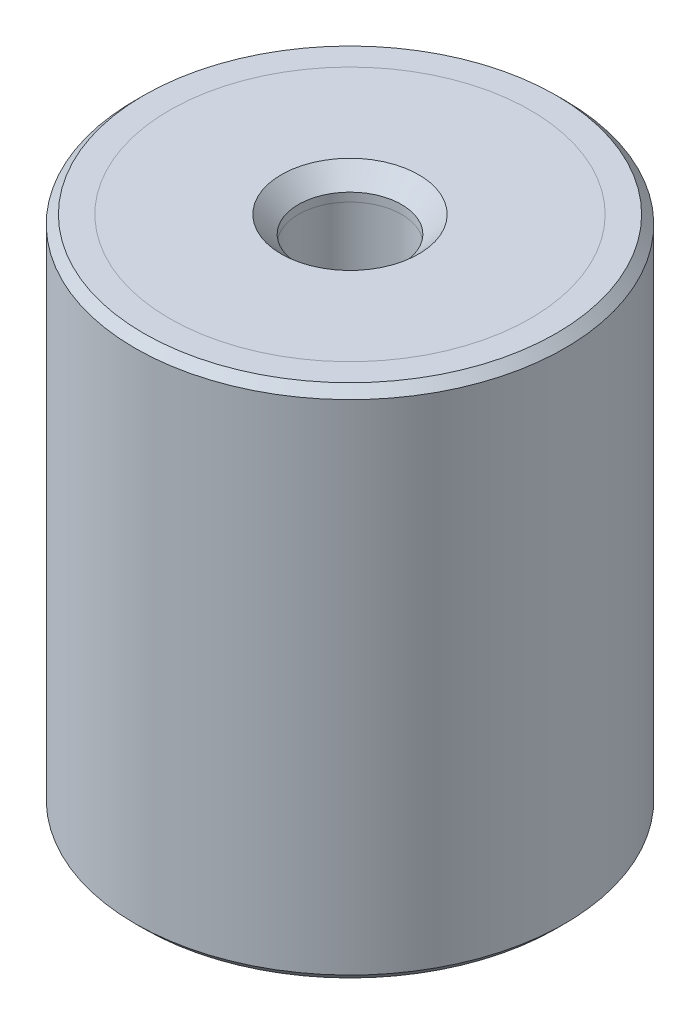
ISO-10303-21;
HEADER;
FILE_DESCRIPTION(('STEP AP214'),'2;1');
FILE_NAME('part.step','',(''),(''),'','','');
FILE_SCHEMA(('AUTOMOTIVE_DESIGN { 1 0 10303 214 1 1 1 1 }'));
ENDSEC;
DATA;
#1=APPLICATION_CONTEXT('core data for automotive mechanical design processes');
#2=APPLICATION_PROTOCOL_DEFINITION('international standard','automotive_design',2000,#1);
#3=PRODUCT_CONTEXT('',#1,'mechanical');
#4=PRODUCT('Part','Part','',(#3));
#5=PRODUCT_RELATED_PRODUCT_CATEGORY('part','',(#4));
#6=PRODUCT_DEFINITION_FORMATION('','',#4);
#7=PRODUCT_DEFINITION_CONTEXT('part definition',#1,'design');
#8=PRODUCT_DEFINITION('design','',#6,#7);
#9=PRODUCT_DEFINITION_SHAPE('','',#8);
#10=(LENGTH_UNIT() NAMED_UNIT(*) SI_UNIT(.MILLI.,.METRE.));
#11=(NAMED_UNIT(*) PLANE_ANGLE_UNIT() SI_UNIT($,.RADIAN.));
#12=(NAMED_UNIT(*) SI_UNIT($,.STERADIAN.) SOLID_ANGLE_UNIT());
#13=UNCERTAINTY_MEASURE_WITH_UNIT(LENGTH_MEASURE(1.E-05),#10,'distance_accuracy_value','');
#14=(GEOMETRIC_REPRESENTATION_CONTEXT(3) GLOBAL_UNCERTAINTY_ASSIGNED_CONTEXT((#13)) GLOBAL_UNIT_ASSIGNED_CONTEXT((#10,
#11,#12)) REPRESENTATION_CONTEXT('',''));
#15=CARTESIAN_POINT('',(0.,0.,0.));
#16=DIRECTION('',(0.,0.,1.));
#17=DIRECTION('',(1.,0.,0.));
#18=AXIS2_PLACEMENT_3D('',#15,#16,#17);
#19=CARTESIAN_POINT('',(0.,41.0340428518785,0.));
#20=DIRECTION('',(0.,1.,0.));
#21=DIRECTION('',(0.,0.,1.));
#22=AXIS2_PLACEMENT_3D('',#19,#20,#21);
#23=CYLINDRICAL_SURFACE('',#22,3.);
#24=CARTESIAN_POINT('',(0.,-27.5,0.));
#25=DIRECTION('',(0.,-1.,0.));
#26=DIRECTION('',(0.,0.,-1.));
#27=AXIS2_PLACEMENT_3D('',#24,#25,#26);
#28=CIRCLE('',#27,3.);
#29=CARTESIAN_POINT('',(0.,-27.5,-3.));
#30=VERTEX_POINT('',#29);
#31=EDGE_CURVE('P0_E10',#30,#30,#28,.T.);
#32=ORIENTED_EDGE('',*,*,#31,.T.);
#33=EDGE_LOOP('',(#32));
#34=FACE_BOUND('',#33,.T.);
#35=CARTESIAN_POINT('',(0.,-27.,0.));
#36=DIRECTION('',(0.,1.,0.));
#37=DIRECTION('',(0.,0.,1.));
#38=AXIS2_PLACEMENT_3D('',#35,#36,#37);
#39=CIRCLE('',#38,3.);
#40=CARTESIAN_POINT('',(0.,-27.,3.));
#41=VERTEX_POINT('',#40);
#42=EDGE_CURVE('P0_E25',#41,#41,#39,.T.);
#43=ORIENTED_EDGE('',*,*,#42,.T.);
#44=EDGE_LOOP('',(#43));
#45=FACE_BOUND('',#44,.T.);
#46=ADVANCED_FACE('P0_F14',(#34,#45),#23,.F.);
#47=CARTESIAN_POINT('',(0.,-27.,3.));
#48=DIRECTION('',(0.,1.,0.));
#49=DIRECTION('',(0.,0.,1.));
#50=AXIS2_PLACEMENT_3D('',#47,#48,#49);
#51=PLANE('',#50);
#52=CARTESIAN_POINT('',(0.,-27.,0.));
#53=DIRECTION('',(0.,1.,0.));
#54=DIRECTION('',(0.,0.,1.));
#55=AXIS2_PLACEMENT_3D('',#52,#53,#54);
#56=CIRCLE('',#55,10.5);
#57=CARTESIAN_POINT('',(0.,-27.,10.5));
#58=VERTEX_POINT('',#57);
#59=EDGE_CURVE('P0_E29',#58,#58,#56,.T.);
#60=ORIENTED_EDGE('',*,*,#59,.T.);
#61=EDGE_LOOP('',(#60));
#62=FACE_BOUND('',#61,.T.);
#63=ORIENTED_EDGE('',*,*,#42,.F.);
#64=EDGE_LOOP('',(#63));
#65=FACE_BOUND('',#64,.T.);
#66=ADVANCED_FACE('P0_F50',(#62,#65),#51,.T.);
#67=CARTESIAN_POINT('',(0.,41.0340428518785,0.));
#68=DIRECTION('',(0.,1.,0.));
#69=DIRECTION('',(0.,0.,1.));
#70=AXIS2_PLACEMENT_3D('',#67,#68,#69);
#71=CYLINDRICAL_SURFACE('',#70,10.5);
#72=CARTESIAN_POINT('',(0.,-28.5,0.));
#73=DIRECTION('',(0.,1.,0.));
#74=DIRECTION('',(0.,0.,1.));
#75=AXIS2_PLACEMENT_3D('',#72,#73,#74);
#76=CIRCLE('',#75,10.5);
#77=CARTESIAN_POINT('',(0.,-28.5,10.5));
#78=VERTEX_POINT('',#77);
#79=EDGE_CURVE('P0_E34',#78,#78,#76,.T.);
#80=ORIENTED_EDGE('',*,*,#79,.T.);
#81=EDGE_LOOP('',(#80));
#82=FACE_BOUND('',#81,.T.);
#83=ORIENTED_EDGE('',*,*,#59,.F.);
#84=EDGE_LOOP('',(#83));
#85=FACE_BOUND('',#84,.T.);
#86=ADVANCED_FACE('P0_F38',(#82,#85),#71,.T.);
#87=CARTESIAN_POINT('',(0.,-28.5,10.5));
#88=DIRECTION('',(0.,-1.,0.));
#89=DIRECTION('',(0.,0.,-1.));
#90=AXIS2_PLACEMENT_3D('',#87,#88,#89);
#91=PLANE('',#90);
#92=CARTESIAN_POINT('',(0.,-28.5,0.));
#93=DIRECTION('',(0.,-1.,0.));
#94=DIRECTION('',(0.,0.,-1.));
#95=AXIS2_PLACEMENT_3D('',#92,#93,#94);
#96=CIRCLE('',#95,4.);
#97=CARTESIAN_POINT('',(0.,-28.5,-4.));
#98=VERTEX_POINT('',#97);
#99=EDGE_CURVE('P0_E21',#98,#98,#96,.F.);
#100=ORIENTED_EDGE('',*,*,#99,.T.);
#101=EDGE_LOOP('',(#100));
#102=FACE_BOUND('',#101,.T.);
#103=ORIENTED_EDGE('',*,*,#79,.F.);
#104=EDGE_LOOP('',(#103));
#105=FACE_BOUND('',#104,.T.);
#106=ADVANCED_FACE('P0_F41',(#102,#105),#91,.T.);
#107=CARTESIAN_POINT('',(0.,-28.5,0.));
#108=DIRECTION('',(0.,-1.,0.));
#109=DIRECTION('',(0.,0.,-1.));
#110=AXIS2_PLACEMENT_3D('',#107,#108,#109);
#111=CONICAL_SURFACE('',#110,4.,0.785398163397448);
#112=ORIENTED_EDGE('',*,*,#31,.F.);
#113=EDGE_LOOP('',(#112));
#114=FACE_BOUND('',#113,.T.);
#115=ORIENTED_EDGE('',*,*,#99,.F.);
#116=EDGE_LOOP('',(#115));
#117=FACE_BOUND('',#116,.T.);
#118=ADVANCED_FACE('P0_F16',(#114,#117),#111,.F.);
#119=CLOSED_SHELL('',(#46,#66,#86,#106,#118));
#120=MANIFOLD_SOLID_BREP('P0_B1',#119);
#121=CARTESIAN_POINT('',(0.,69.5340428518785,0.));
#122=DIRECTION('',(0.,1.,0.));
#123=DIRECTION('',(0.,0.,1.));
#124=AXIS2_PLACEMENT_3D('',#121,#122,#123);
#125=CYLINDRICAL_SURFACE('',#124,3.);
#126=CARTESIAN_POINT('',(0.,0.5,0.));
#127=DIRECTION('',(0.,1.,0.));
#128=DIRECTION('',(0.,0.,1.));
#129=AXIS2_PLACEMENT_3D('',#126,#127,#128);
#130=CIRCLE('',#129,3.);
#131=CARTESIAN_POINT('',(0.,0.5,3.));
#132=VERTEX_POINT('',#131);
#133=EDGE_CURVE('P1_E21',#132,#132,#130,.T.);
#134=ORIENTED_EDGE('',*,*,#133,.T.);
#135=EDGE_LOOP('',(#134));
#136=FACE_BOUND('',#135,.T.);
#137=CARTESIAN_POINT('',(0.,0.,0.));
#138=DIRECTION('',(0.,1.,0.));
#139=DIRECTION('',(0.,0.,1.));
#140=AXIS2_PLACEMENT_3D('',#137,#138,#139);
#141=CIRCLE('',#140,3.);
#142=CARTESIAN_POINT('',(0.,0.,3.));
#143=VERTEX_POINT('',#142);
#144=EDGE_CURVE('P1_E34',#143,#143,#141,.T.);
#145=ORIENTED_EDGE('',*,*,#144,.F.);
#146=EDGE_LOOP('',(#145));
#147=FACE_BOUND('',#146,.T.);
#148=ADVANCED_FACE('P1_F14',(#136,#147),#125,.F.);
#149=CARTESIAN_POINT('',(0.,1.5,3.));
#150=DIRECTION('',(0.,1.,0.));
#151=DIRECTION('',(0.,0.,1.));
#152=AXIS2_PLACEMENT_3D('',#149,#150,#151);
#153=PLANE('',#152);
#154=CARTESIAN_POINT('',(0.,1.5,0.));
#155=DIRECTION('',(0.,1.,0.));
#156=DIRECTION('',(0.,0.,1.));
#157=AXIS2_PLACEMENT_3D('',#154,#155,#156);
#158=CIRCLE('',#157,4.);
#159=CARTESIAN_POINT('',(0.,1.5,4.));
#160=VERTEX_POINT('',#159);
#161=EDGE_CURVE('P1_E10',#160,#160,#158,.F.);
#162=ORIENTED_EDGE('',*,*,#161,.T.);
#163=EDGE_LOOP('',(#162));
#164=FACE_BOUND('',#163,.T.);
#165=CARTESIAN_POINT('',(0.,1.5,0.));
#166=DIRECTION('',(0.,1.,0.));
#167=DIRECTION('',(0.,0.,1.));
#168=AXIS2_PLACEMENT_3D('',#165,#166,#167);
#169=CIRCLE('',#168,10.5);
#170=CARTESIAN_POINT('',(0.,1.5,10.5));
#171=VERTEX_POINT('',#170);
#172=EDGE_CURVE('P1_E25',#171,#171,#169,.T.);
#173=ORIENTED_EDGE('',*,*,#172,.T.);
#174=EDGE_LOOP('',(#173));
#175=FACE_BOUND('',#174,.T.);
#176=ADVANCED_FACE('P1_F42',(#164,#175),#153,.T.);
#177=CARTESIAN_POINT('',(0.,69.5340428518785,0.));
#178=DIRECTION('',(0.,1.,0.));
#179=DIRECTION('',(0.,0.,1.));
#180=AXIS2_PLACEMENT_3D('',#177,#178,#179);
#181=CYLINDRICAL_SURFACE('',#180,10.5);
#182=CARTESIAN_POINT('',(0.,0.,0.));
#183=DIRECTION('',(0.,1.,0.));
#184=DIRECTION('',(0.,0.,1.));
#185=AXIS2_PLACEMENT_3D('',#182,#183,#184);
#186=CIRCLE('',#185,10.5);
#187=CARTESIAN_POINT('',(0.,0.,10.5));
#188=VERTEX_POINT('',#187);
#189=EDGE_CURVE('P1_E29',#188,#188,#186,.T.);
#190=ORIENTED_EDGE('',*,*,#189,.T.);
#191=EDGE_LOOP('',(#190));
#192=FACE_BOUND('',#191,.T.);
#193=ORIENTED_EDGE('',*,*,#172,.F.);
#194=EDGE_LOOP('',(#193));
#195=FACE_BOUND('',#194,.T.);
#196=ADVANCED_FACE('P1_F47',(#192,#195),#181,.T.);
#197=CARTESIAN_POINT('',(0.,0.,10.5));
#198=DIRECTION('',(0.,-1.,0.));
#199=DIRECTION('',(0.,0.,-1.));
#200=AXIS2_PLACEMENT_3D('',#197,#198,#199);
#201=PLANE('',#200);
#202=ORIENTED_EDGE('',*,*,#144,.T.);
#203=EDGE_LOOP('',(#202));
#204=FACE_BOUND('',#203,.T.);
#205=ORIENTED_EDGE('',*,*,#189,.F.);
#206=EDGE_LOOP('',(#205));
#207=FACE_BOUND('',#206,.T.);
#208=ADVANCED_FACE('P1_F38',(#204,#207),#201,.T.);
#209=CARTESIAN_POINT('',(0.,0.5,0.));
#210=DIRECTION('',(0.,1.,0.));
#211=DIRECTION('',(0.,0.,1.));
#212=AXIS2_PLACEMENT_3D('',#209,#210,#211);
#213=CONICAL_SURFACE('',#212,3.,0.78539816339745);
#214=ORIENTED_EDGE('',*,*,#161,.F.);
#215=EDGE_LOOP('',(#214));
#216=FACE_BOUND('',#215,.T.);
#217=ORIENTED_EDGE('',*,*,#133,.F.);
#218=EDGE_LOOP('',(#217));
#219=FACE_BOUND('',#218,.T.);
#220=ADVANCED_FACE('P1_F16',(#216,#219),#213,.F.);
#221=CLOSED_SHELL('',(#148,#176,#196,#208,#220));
#222=MANIFOLD_SOLID_BREP('P1_B1',#221);
#223=CARTESIAN_POINT('',(0.,0.,0.));
#224=DIRECTION('',(0.,1.,0.));
#225=DIRECTION('',(0.,0.,1.));
#226=AXIS2_PLACEMENT_3D('',#223,#224,#225);
#227=PLANE('',#226);
#228=CARTESIAN_POINT('',(0.,0.,0.));
#229=DIRECTION('',(0.,1.,0.));
#230=DIRECTION('',(0.,0.,1.));
#231=AXIS2_PLACEMENT_3D('',#228,#229,#230);
#232=CIRCLE('',#231,3.);
#233=CARTESIAN_POINT('',(0.,0.,3.));
#234=VERTEX_POINT('',#233);
#235=EDGE_CURVE('P2_E46',#234,#234,#232,.T.);
#236=ORIENTED_EDGE('',*,*,#235,.F.);
#237=EDGE_LOOP('',(#236));
#238=FACE_BOUND('',#237,.T.);
#239=CARTESIAN_POINT('',(0.,0.,0.));
#240=DIRECTION('',(0.,1.,0.));
#241=DIRECTION('',(0.,0.,1.));
#242=AXIS2_PLACEMENT_3D('',#239,#240,#241);
#243=CIRCLE('',#242,10.5);
#244=CARTESIAN_POINT('',(0.,0.,10.5));
#245=VERTEX_POINT('',#244);
#246=EDGE_CURVE('P2_E33',#245,#245,#243,.T.);
#247=ORIENTED_EDGE('',*,*,#246,.T.);
#248=EDGE_LOOP('',(#247));
#249=FACE_BOUND('',#248,.T.);
#250=ADVANCED_FACE('P2_F13',(#238,#249),#227,.T.);
#251=CARTESIAN_POINT('',(0.,65.5134936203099,0.));
#252=DIRECTION('',(0.,1.,0.));
#253=DIRECTION('',(0.,0.,1.));
#254=AXIS2_PLACEMENT_3D('',#251,#252,#253);
#255=CYLINDRICAL_SURFACE('',#254,10.5);
#256=CARTESIAN_POINT('',(0.,1.5,0.));
#257=DIRECTION('',(0.,1.,0.));
#258=DIRECTION('',(0.,0.,1.));
#259=AXIS2_PLACEMENT_3D('',#256,#257,#258);
#260=CIRCLE('',#259,10.5);
#261=CARTESIAN_POINT('',(0.,1.5,10.5));
#262=VERTEX_POINT('',#261);
#263=EDGE_CURVE('P2_E36',#262,#262,#260,.T.);
#264=ORIENTED_EDGE('',*,*,#263,.T.);
#265=EDGE_LOOP('',(#264));
#266=FACE_BOUND('',#265,.T.);
#267=ORIENTED_EDGE('',*,*,#246,.F.);
#268=EDGE_LOOP('',(#267));
#269=FACE_BOUND('',#268,.T.);
#270=ADVANCED_FACE('P2_F92',(#266,#269),#255,.F.);
#271=CARTESIAN_POINT('',(0.,1.5,10.5));
#272=DIRECTION('',(0.,1.,0.));
#273=DIRECTION('',(0.,0.,1.));
#274=AXIS2_PLACEMENT_3D('',#271,#272,#273);
#275=PLANE('',#274);
#276=CARTESIAN_POINT('',(0.,1.5,0.));
#277=DIRECTION('',(0.,1.,0.));
#278=DIRECTION('',(0.,0.,1.));
#279=AXIS2_PLACEMENT_3D('',#276,#277,#278);
#280=CIRCLE('',#279,12.);
#281=CARTESIAN_POINT('',(0.,1.5,12.));
#282=VERTEX_POINT('',#281);
#283=EDGE_CURVE('P2_E9',#282,#282,#280,.T.);
#284=ORIENTED_EDGE('',*,*,#283,.T.);
#285=EDGE_LOOP('',(#284));
#286=FACE_BOUND('',#285,.T.);
#287=ORIENTED_EDGE('',*,*,#263,.F.);
#288=EDGE_LOOP('',(#287));
#289=FACE_BOUND('',#288,.T.);
#290=ADVANCED_FACE('P2_F88',(#286,#289),#275,.T.);
#291=CARTESIAN_POINT('',(0.,65.5134936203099,0.));
#292=DIRECTION('',(0.,1.,0.));
#293=DIRECTION('',(0.,0.,1.));
#294=AXIS2_PLACEMENT_3D('',#291,#292,#293);
#295=CYLINDRICAL_SURFACE('',#294,12.5);
#296=CARTESIAN_POINT('',(0.,-28.,0.));
#297=DIRECTION('',(0.,-1.,0.));
#298=DIRECTION('',(0.,0.,-1.));
#299=AXIS2_PLACEMENT_3D('',#296,#297,#298);
#300=CIRCLE('',#299,12.5);
#301=CARTESIAN_POINT('',(0.,-28.,-12.5));
#302=VERTEX_POINT('',#301);
#303=EDGE_CURVE('P2_E24',#302,#302,#300,.F.);
#304=ORIENTED_EDGE('',*,*,#303,.T.);
#305=EDGE_LOOP('',(#304));
#306=FACE_BOUND('',#305,.T.);
#307=CARTESIAN_POINT('',(0.,1.00000000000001,0.));
#308=DIRECTION('',(0.,1.,0.));
#309=DIRECTION('',(0.,0.,1.));
#310=AXIS2_PLACEMENT_3D('',#307,#308,#309);
#311=CIRCLE('',#310,12.5);
#312=CARTESIAN_POINT('',(0.,1.00000000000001,12.5));
#313=VERTEX_POINT('',#312);
#314=EDGE_CURVE('P2_E28',#313,#313,#311,.F.);
#315=ORIENTED_EDGE('',*,*,#314,.T.);
#316=EDGE_LOOP('',(#315));
#317=FACE_BOUND('',#316,.T.);
#318=ADVANCED_FACE('P2_F82',(#306,#317),#295,.T.);
#319=CARTESIAN_POINT('',(0.,-28.5,12.5));
#320=DIRECTION('',(0.,-1.,0.));
#321=DIRECTION('',(0.,0.,-1.));
#322=AXIS2_PLACEMENT_3D('',#319,#320,#321);
#323=PLANE('',#322);
#324=CARTESIAN_POINT('',(0.,-28.5,0.));
#325=DIRECTION('',(0.,-1.,0.));
#326=DIRECTION('',(0.,0.,-1.));
#327=AXIS2_PLACEMENT_3D('',#324,#325,#326);
#328=CIRCLE('',#327,12.);
#329=CARTESIAN_POINT('',(0.,-28.5,-12.));
#330=VERTEX_POINT('',#329);
#331=EDGE_CURVE('P2_E20',#330,#330,#328,.T.);
#332=ORIENTED_EDGE('',*,*,#331,.T.);
#333=EDGE_LOOP('',(#332));
#334=FACE_BOUND('',#333,.T.);
#335=CARTESIAN_POINT('',(0.,-28.5,0.));
#336=DIRECTION('',(0.,1.,0.));
#337=DIRECTION('',(0.,0.,1.));
#338=AXIS2_PLACEMENT_3D('',#335,#336,#337);
#339=CIRCLE('',#338,10.5);
#340=CARTESIAN_POINT('',(0.,-28.5,10.5));
#341=VERTEX_POINT('',#340);
#342=EDGE_CURVE('P2_E39',#341,#341,#339,.T.);
#343=ORIENTED_EDGE('',*,*,#342,.T.);
#344=EDGE_LOOP('',(#343));
#345=FACE_BOUND('',#344,.T.);
#346=ADVANCED_FACE('P2_F77',(#334,#345),#323,.T.);
#347=CARTESIAN_POINT('',(0.,65.5134936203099,0.));
#348=DIRECTION('',(0.,1.,0.));
#349=DIRECTION('',(0.,0.,1.));
#350=AXIS2_PLACEMENT_3D('',#347,#348,#349);
#351=CYLINDRICAL_SURFACE('',#350,10.5);
#352=CARTESIAN_POINT('',(0.,-27.,0.));
#353=DIRECTION('',(0.,1.,0.));
#354=DIRECTION('',(0.,0.,1.));
#355=AXIS2_PLACEMENT_3D('',#352,#353,#354);
#356=CIRCLE('',#355,10.5);
#357=CARTESIAN_POINT('',(0.,-27.,10.5));
#358=VERTEX_POINT('',#357);
#359=EDGE_CURVE('P2_E42',#358,#358,#356,.T.);
#360=ORIENTED_EDGE('',*,*,#359,.T.);
#361=EDGE_LOOP('',(#360));
#362=FACE_BOUND('',#361,.T.);
#363=ORIENTED_EDGE('',*,*,#342,.F.);
#364=EDGE_LOOP('',(#363));
#365=FACE_BOUND('',#364,.T.);
#366=ADVANCED_FACE('P2_F71',(#362,#365),#351,.F.);
#367=CARTESIAN_POINT('',(0.,-27.,10.5));
#368=DIRECTION('',(0.,-1.,0.));
#369=DIRECTION('',(0.,0.,-1.));
#370=AXIS2_PLACEMENT_3D('',#367,#368,#369);
#371=PLANE('',#370);
#372=CARTESIAN_POINT('',(0.,-27.,0.));
#373=DIRECTION('',(0.,-1.,0.));
#374=DIRECTION('',(0.,0.,-1.));
#375=AXIS2_PLACEMENT_3D('',#372,#373,#374);
#376=CIRCLE('',#375,3.);
#377=CARTESIAN_POINT('',(0.,-27.,-3.));
#378=VERTEX_POINT('',#377);
#379=EDGE_CURVE('P2_E52',#378,#378,#376,.T.);
#380=ORIENTED_EDGE('',*,*,#379,.F.);
#381=EDGE_LOOP('',(#380));
#382=FACE_BOUND('',#381,.T.);
#383=ORIENTED_EDGE('',*,*,#359,.F.);
#384=EDGE_LOOP('',(#383));
#385=FACE_BOUND('',#384,.T.);
#386=ADVANCED_FACE('P2_F67',(#382,#385),#371,.T.);
#387=CARTESIAN_POINT('',(0.,-28.,0.));
#388=DIRECTION('',(0.,1.,0.));
#389=DIRECTION('',(0.,0.,1.));
#390=AXIS2_PLACEMENT_3D('',#387,#388,#389);
#391=CONICAL_SURFACE('',#390,12.5,0.785398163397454);
#392=ORIENTED_EDGE('',*,*,#331,.F.);
#393=EDGE_LOOP('',(#392));
#394=FACE_BOUND('',#393,.T.);
#395=ORIENTED_EDGE('',*,*,#303,.F.);
#396=EDGE_LOOP('',(#395));
#397=FACE_BOUND('',#396,.T.);
#398=ADVANCED_FACE('P2_F70',(#394,#397),#391,.T.);
#399=CARTESIAN_POINT('',(0.,1.5,0.));
#400=DIRECTION('',(0.,-1.,0.));
#401=DIRECTION('',(0.,0.,-1.));
#402=AXIS2_PLACEMENT_3D('',#399,#400,#401);
#403=CONICAL_SURFACE('',#402,12.,0.785398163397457);
#404=ORIENTED_EDGE('',*,*,#314,.F.);
#405=EDGE_LOOP('',(#404));
#406=FACE_BOUND('',#405,.T.);
#407=ORIENTED_EDGE('',*,*,#283,.F.);
#408=EDGE_LOOP('',(#407));
#409=FACE_BOUND('',#408,.T.);
#410=ADVANCED_FACE('P2_F15',(#406,#409),#403,.T.);
#411=CARTESIAN_POINT('',(0.,-4.5,0.));
#412=DIRECTION('',(0.,1.,0.));
#413=DIRECTION('',(0.,0.,1.));
#414=AXIS2_PLACEMENT_3D('',#411,#412,#413);
#415=CYLINDRICAL_SURFACE('',#414,3.);
#416=CARTESIAN_POINT('',(0.,-4.5,0.));
#417=DIRECTION('',(0.,1.,0.));
#418=DIRECTION('',(0.,0.,1.));
#419=AXIS2_PLACEMENT_3D('',#416,#417,#418);
#420=CIRCLE('',#419,3.);
#421=CARTESIAN_POINT('',(0.,-4.5,3.));
#422=VERTEX_POINT('',#421);
#423=EDGE_CURVE('P2_E45',#422,#422,#420,.T.);
#424=ORIENTED_EDGE('',*,*,#423,.F.);
#425=EDGE_LOOP('',(#424));
#426=FACE_BOUND('',#425,.T.);
#427=ORIENTED_EDGE('',*,*,#235,.T.);
#428=EDGE_LOOP('',(#427));
#429=FACE_BOUND('',#428,.T.);
#430=ADVANCED_FACE('P2_F108',(#426,#429),#415,.F.);
#431=CARTESIAN_POINT('',(0.,-4.5,0.));
#432=DIRECTION('',(0.,1.,0.));
#433=DIRECTION('',(0.,0.,1.));
#434=AXIS2_PLACEMENT_3D('',#431,#432,#433);
#435=PLANE('',#434);
#436=ORIENTED_EDGE('',*,*,#423,.T.);
#437=EDGE_LOOP('',(#436));
#438=FACE_BOUND('',#437,.T.);
#439=ADVANCED_FACE('P2_F63',(#438),#435,.T.);
#440=CARTESIAN_POINT('',(0.,-22.5,0.));
#441=DIRECTION('',(0.,-1.,0.));
#442=DIRECTION('',(0.,0.,-1.));
#443=AXIS2_PLACEMENT_3D('',#440,#441,#442);
#444=CYLINDRICAL_SURFACE('',#443,3.);
#445=CARTESIAN_POINT('',(0.,-22.5,0.));
#446=DIRECTION('',(0.,-1.,0.));
#447=DIRECTION('',(0.,0.,-1.));
#448=AXIS2_PLACEMENT_3D('',#445,#446,#447);
#449=CIRCLE('',#448,3.);
#450=CARTESIAN_POINT('',(0.,-22.5,-3.));
#451=VERTEX_POINT('',#450);
#452=EDGE_CURVE('P2_E49',#451,#451,#449,.T.);
#453=ORIENTED_EDGE('',*,*,#452,.F.);
#454=EDGE_LOOP('',(#453));
#455=FACE_BOUND('',#454,.T.);
#456=ORIENTED_EDGE('',*,*,#379,.T.);
#457=EDGE_LOOP('',(#456));
#458=FACE_BOUND('',#457,.T.);
#459=ADVANCED_FACE('P2_F60',(#455,#458),#444,.F.);
#460=CARTESIAN_POINT('',(0.,-22.5,0.));
#461=DIRECTION('',(0.,-1.,0.));
#462=DIRECTION('',(0.,0.,-1.));
#463=AXIS2_PLACEMENT_3D('',#460,#461,#462);
#464=PLANE('',#463);
#465=ORIENTED_EDGE('',*,*,#452,.T.);
#466=EDGE_LOOP('',(#465));
#467=FACE_BOUND('',#466,.T.);
#468=ADVANCED_FACE('P2_F58',(#467),#464,.T.);
#469=CLOSED_SHELL('',(#250,#270,#290,#318,#346,#366,#386,#398,#410,#430,#439,#459,#468));
#470=MANIFOLD_SOLID_BREP('P2_B1',#469);
#471=ADVANCED_BREP_SHAPE_REPRESENTATION('',(#18,#120,#222,#470),#14);
#472=SHAPE_DEFINITION_REPRESENTATION(#9,#471);
ENDSEC;
END-ISO-10303-21;
